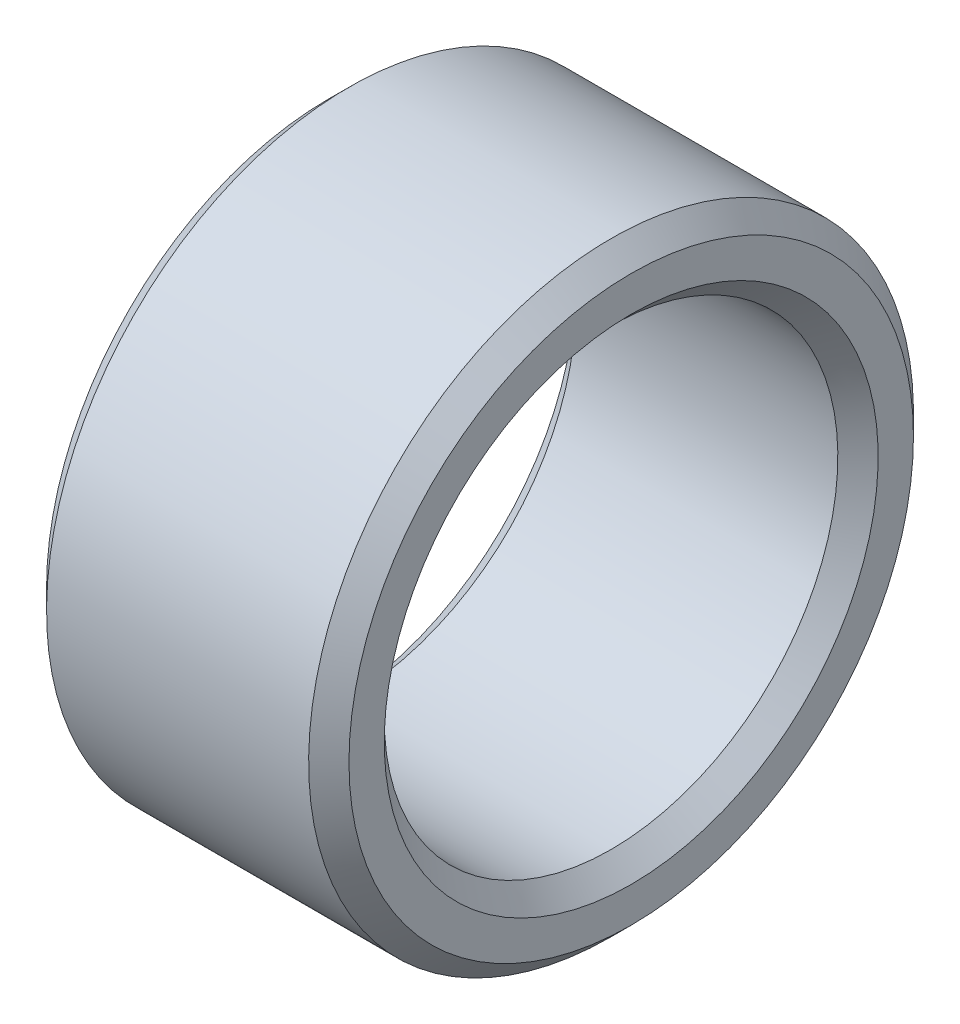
ISO-10303-21;
HEADER;
FILE_DESCRIPTION(('STEP AP214'),'2;1');
FILE_NAME('part.step','',(''),(''),'','','');
FILE_SCHEMA(('AUTOMOTIVE_DESIGN { 1 0 10303 214 1 1 1 1 }'));
ENDSEC;
DATA;
#1=APPLICATION_CONTEXT('core data for automotive mechanical design processes');
#2=APPLICATION_PROTOCOL_DEFINITION('international standard','automotive_design',2000,#1);
#3=PRODUCT_CONTEXT('',#1,'mechanical');
#4=PRODUCT('Part','Part','',(#3));
#5=PRODUCT_RELATED_PRODUCT_CATEGORY('part','',(#4));
#6=PRODUCT_DEFINITION_FORMATION('','',#4);
#7=PRODUCT_DEFINITION_CONTEXT('part definition',#1,'design');
#8=PRODUCT_DEFINITION('design','',#6,#7);
#9=PRODUCT_DEFINITION_SHAPE('','',#8);
#10=(LENGTH_UNIT() NAMED_UNIT(*) SI_UNIT(.MILLI.,.METRE.));
#11=(NAMED_UNIT(*) PLANE_ANGLE_UNIT() SI_UNIT($,.RADIAN.));
#12=(NAMED_UNIT(*) SI_UNIT($,.STERADIAN.) SOLID_ANGLE_UNIT());
#13=UNCERTAINTY_MEASURE_WITH_UNIT(LENGTH_MEASURE(1.E-05),#10,'distance_accuracy_value','');
#14=(GEOMETRIC_REPRESENTATION_CONTEXT(3) GLOBAL_UNCERTAINTY_ASSIGNED_CONTEXT((#13)) GLOBAL_UNIT_ASSIGNED_CONTEXT((#10,
#11,#12)) REPRESENTATION_CONTEXT('',''));
#15=CARTESIAN_POINT('',(0.,0.,0.));
#16=DIRECTION('',(0.,0.,1.));
#17=DIRECTION('',(1.,0.,0.));
#18=AXIS2_PLACEMENT_3D('',#15,#16,#17);
#19=CARTESIAN_POINT('',(0.,-5.25,0.));
#20=DIRECTION('',(-1.,0.,0.));
#21=DIRECTION('',(0.,1.,0.));
#22=AXIS2_PLACEMENT_3D('',#19,#20,#21);
#23=PLANE('',#22);
#24=CARTESIAN_POINT('',(0.,0.,0.));
#25=DIRECTION('',(1.,0.,0.));
#26=DIRECTION('',(0.,-1.,0.));
#27=AXIS2_PLACEMENT_3D('',#24,#25,#26);
#28=CIRCLE('',#27,4.9);
#29=CARTESIAN_POINT('',(0.,-4.9,0.));
#30=VERTEX_POINT('',#29);
#31=EDGE_CURVE('E10',#30,#30,#28,.T.);
#32=ORIENTED_EDGE('',*,*,#31,.T.);
#33=EDGE_LOOP('',(#32));
#34=FACE_BOUND('',#33,.T.);
#35=CARTESIAN_POINT('',(0.,0.,0.));
#36=DIRECTION('',(1.,0.,0.));
#37=DIRECTION('',(0.,-1.,0.));
#38=AXIS2_PLACEMENT_3D('',#35,#36,#37);
#39=CIRCLE('',#38,5.6);
#40=CARTESIAN_POINT('',(0.,-5.6,0.));
#41=VERTEX_POINT('',#40);
#42=EDGE_CURVE('E54',#41,#41,#39,.T.);
#43=ORIENTED_EDGE('',*,*,#42,.F.);
#44=EDGE_LOOP('',(#43));
#45=FACE_BOUND('',#44,.T.);
#46=ADVANCED_FACE('F16',(#34,#45),#23,.T.);
#47=CARTESIAN_POINT('',(0.2,0.,0.));
#48=DIRECTION('',(-1.,0.,0.));
#49=DIRECTION('',(0.,-1.,0.));
#50=AXIS2_PLACEMENT_3D('',#47,#48,#49);
#51=CONICAL_SURFACE('',#50,4.7,0.785398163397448);
#52=CARTESIAN_POINT('',(0.4,0.,0.));
#53=DIRECTION('',(1.,0.,0.));
#54=DIRECTION('',(0.,-1.,0.));
#55=AXIS2_PLACEMENT_3D('',#52,#53,#54);
#56=CIRCLE('',#55,4.5);
#57=CARTESIAN_POINT('',(0.4,-4.5,0.));
#58=VERTEX_POINT('',#57);
#59=EDGE_CURVE('E23',#58,#58,#56,.T.);
#60=ORIENTED_EDGE('',*,*,#59,.T.);
#61=EDGE_LOOP('',(#60));
#62=FACE_BOUND('',#61,.T.);
#63=ORIENTED_EDGE('',*,*,#31,.F.);
#64=EDGE_LOOP('',(#63));
#65=FACE_BOUND('',#64,.T.);
#66=ADVANCED_FACE('F83',(#62,#65),#51,.F.);
#67=CARTESIAN_POINT('',(3.,0.,0.));
#68=DIRECTION('',(-1.,0.,0.));
#69=DIRECTION('',(0.,-1.,0.));
#70=AXIS2_PLACEMENT_3D('',#67,#68,#69);
#71=CYLINDRICAL_SURFACE('',#70,4.5);
#72=CARTESIAN_POINT('',(5.6,0.,0.));
#73=DIRECTION('',(1.,0.,0.));
#74=DIRECTION('',(0.,-1.,0.));
#75=AXIS2_PLACEMENT_3D('',#72,#73,#74);
#76=CIRCLE('',#75,4.5);
#77=CARTESIAN_POINT('',(5.6,-4.5,0.));
#78=VERTEX_POINT('',#77);
#79=EDGE_CURVE('E59',#78,#78,#76,.T.);
#80=ORIENTED_EDGE('',*,*,#79,.T.);
#81=EDGE_LOOP('',(#80));
#82=FACE_BOUND('',#81,.T.);
#83=ORIENTED_EDGE('',*,*,#59,.F.);
#84=EDGE_LOOP('',(#83));
#85=FACE_BOUND('',#84,.T.);
#86=ADVANCED_FACE('F67',(#82,#85),#71,.F.);
#87=CARTESIAN_POINT('',(5.8,0.,0.));
#88=DIRECTION('',(1.,0.,0.));
#89=DIRECTION('',(0.,-1.,0.));
#90=AXIS2_PLACEMENT_3D('',#87,#88,#89);
#91=CONICAL_SURFACE('',#90,4.7,0.78539816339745);
#92=CARTESIAN_POINT('',(6.,0.,0.));
#93=DIRECTION('',(1.,0.,0.));
#94=DIRECTION('',(0.,-1.,0.));
#95=AXIS2_PLACEMENT_3D('',#92,#93,#94);
#96=CIRCLE('',#95,4.9);
#97=CARTESIAN_POINT('',(6.,-4.9,0.));
#98=VERTEX_POINT('',#97);
#99=EDGE_CURVE('E64',#98,#98,#96,.T.);
#100=ORIENTED_EDGE('',*,*,#99,.T.);
#101=EDGE_LOOP('',(#100));
#102=FACE_BOUND('',#101,.T.);
#103=ORIENTED_EDGE('',*,*,#79,.F.);
#104=EDGE_LOOP('',(#103));
#105=FACE_BOUND('',#104,.T.);
#106=ADVANCED_FACE('F70',(#102,#105),#91,.F.);
#107=CARTESIAN_POINT('',(6.,-5.25,0.));
#108=DIRECTION('',(1.,0.,0.));
#109=DIRECTION('',(0.,-1.,0.));
#110=AXIS2_PLACEMENT_3D('',#107,#108,#109);
#111=PLANE('',#110);
#112=CARTESIAN_POINT('',(6.,0.,0.));
#113=DIRECTION('',(1.,0.,0.));
#114=DIRECTION('',(0.,-1.,0.));
#115=AXIS2_PLACEMENT_3D('',#112,#113,#114);
#116=CIRCLE('',#115,5.6);
#117=CARTESIAN_POINT('',(6.,-5.6,0.));
#118=VERTEX_POINT('',#117);
#119=EDGE_CURVE('E62',#118,#118,#116,.T.);
#120=ORIENTED_EDGE('',*,*,#119,.T.);
#121=EDGE_LOOP('',(#120));
#122=FACE_BOUND('',#121,.T.);
#123=ORIENTED_EDGE('',*,*,#99,.F.);
#124=EDGE_LOOP('',(#123));
#125=FACE_BOUND('',#124,.T.);
#126=ADVANCED_FACE('F72',(#122,#125),#111,.T.);
#127=CARTESIAN_POINT('',(5.8,0.,0.));
#128=DIRECTION('',(-1.,0.,0.));
#129=DIRECTION('',(0.,-1.,0.));
#130=AXIS2_PLACEMENT_3D('',#127,#128,#129);
#131=CONICAL_SURFACE('',#130,5.8,0.785398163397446);
#132=CARTESIAN_POINT('',(5.6,0.,0.));
#133=DIRECTION('',(1.,0.,0.));
#134=DIRECTION('',(0.,-1.,0.));
#135=AXIS2_PLACEMENT_3D('',#132,#133,#134);
#136=CIRCLE('',#135,6.);
#137=CARTESIAN_POINT('',(5.6,-6.,0.));
#138=VERTEX_POINT('',#137);
#139=EDGE_CURVE('E56',#138,#138,#136,.T.);
#140=ORIENTED_EDGE('',*,*,#139,.T.);
#141=EDGE_LOOP('',(#140));
#142=FACE_BOUND('',#141,.T.);
#143=ORIENTED_EDGE('',*,*,#119,.F.);
#144=EDGE_LOOP('',(#143));
#145=FACE_BOUND('',#144,.T.);
#146=ADVANCED_FACE('F80',(#142,#145),#131,.T.);
#147=CARTESIAN_POINT('',(3.,0.,0.));
#148=DIRECTION('',(-1.,0.,0.));
#149=DIRECTION('',(0.,-1.,0.));
#150=AXIS2_PLACEMENT_3D('',#147,#148,#149);
#151=CYLINDRICAL_SURFACE('',#150,6.);
#152=CARTESIAN_POINT('',(0.4,0.,0.));
#153=DIRECTION('',(1.,0.,0.));
#154=DIRECTION('',(0.,-1.,0.));
#155=AXIS2_PLACEMENT_3D('',#152,#153,#154);
#156=CIRCLE('',#155,6.);
#157=CARTESIAN_POINT('',(0.4,-6.,0.));
#158=VERTEX_POINT('',#157);
#159=EDGE_CURVE('E50',#158,#158,#156,.T.);
#160=ORIENTED_EDGE('',*,*,#159,.T.);
#161=EDGE_LOOP('',(#160));
#162=FACE_BOUND('',#161,.T.);
#163=ORIENTED_EDGE('',*,*,#139,.F.);
#164=EDGE_LOOP('',(#163));
#165=FACE_BOUND('',#164,.T.);
#166=ADVANCED_FACE('F51',(#162,#165),#151,.T.);
#167=CARTESIAN_POINT('',(0.2,0.,0.));
#168=DIRECTION('',(1.,0.,0.));
#169=DIRECTION('',(0.,-1.,0.));
#170=AXIS2_PLACEMENT_3D('',#167,#168,#169);
#171=CONICAL_SURFACE('',#170,5.8,0.785398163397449);
#172=ORIENTED_EDGE('',*,*,#42,.T.);
#173=EDGE_LOOP('',(#172));
#174=FACE_BOUND('',#173,.T.);
#175=ORIENTED_EDGE('',*,*,#159,.F.);
#176=EDGE_LOOP('',(#175));
#177=FACE_BOUND('',#176,.T.);
#178=ADVANCED_FACE('F93',(#174,#177),#171,.T.);
#179=CLOSED_SHELL('',(#46,#66,#86,#106,#126,#146,#166,#178));
#180=MANIFOLD_SOLID_BREP('B1',#179);
#181=ADVANCED_BREP_SHAPE_REPRESENTATION('',(#18,#180),#14);
#182=SHAPE_DEFINITION_REPRESENTATION(#9,#181);
ENDSEC;
END-ISO-10303-21;
